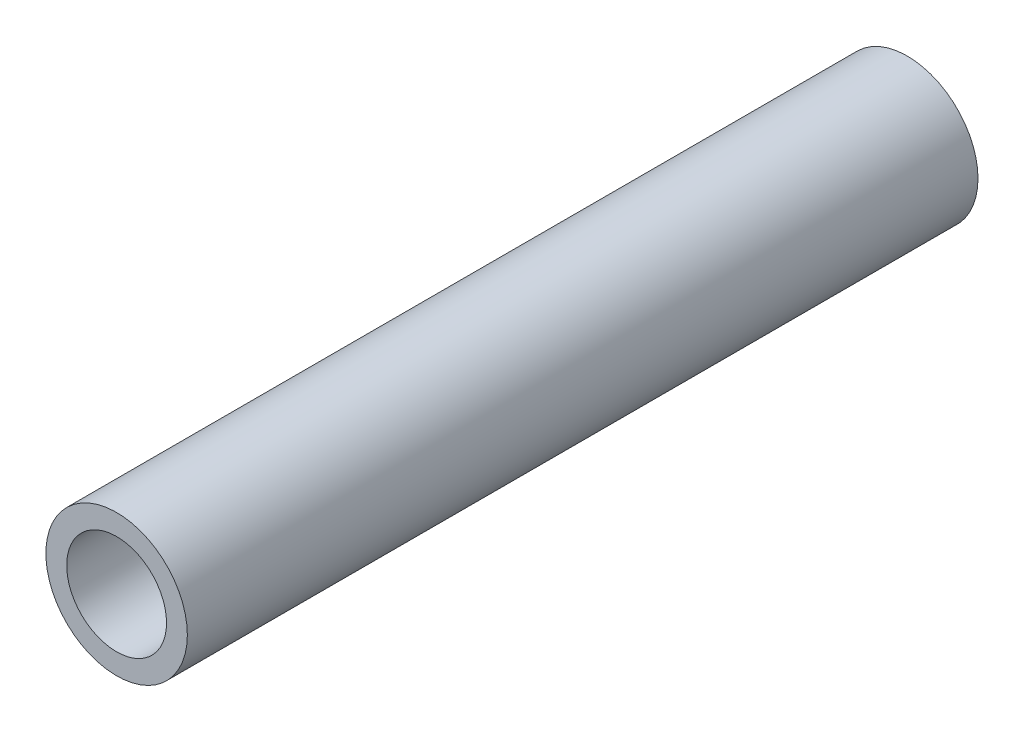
from build123d import *

# Parameters (mm, degrees)
ESQUISSE1_R      = 8.5
ESQUISSE1_R_2    = 6
EXTRUSION1_DEPTH = 95


with BuildPart() as part:
    # Esquisse1 → Extrusion1 (new body)
    with BuildSketch(Plane.XY):
        Circle(ESQUISSE1_R)
        Circle(ESQUISSE1_R_2, mode=Mode.SUBTRACT)
    extrude(amount=EXTRUSION1_DEPTH)


solid = part.part
